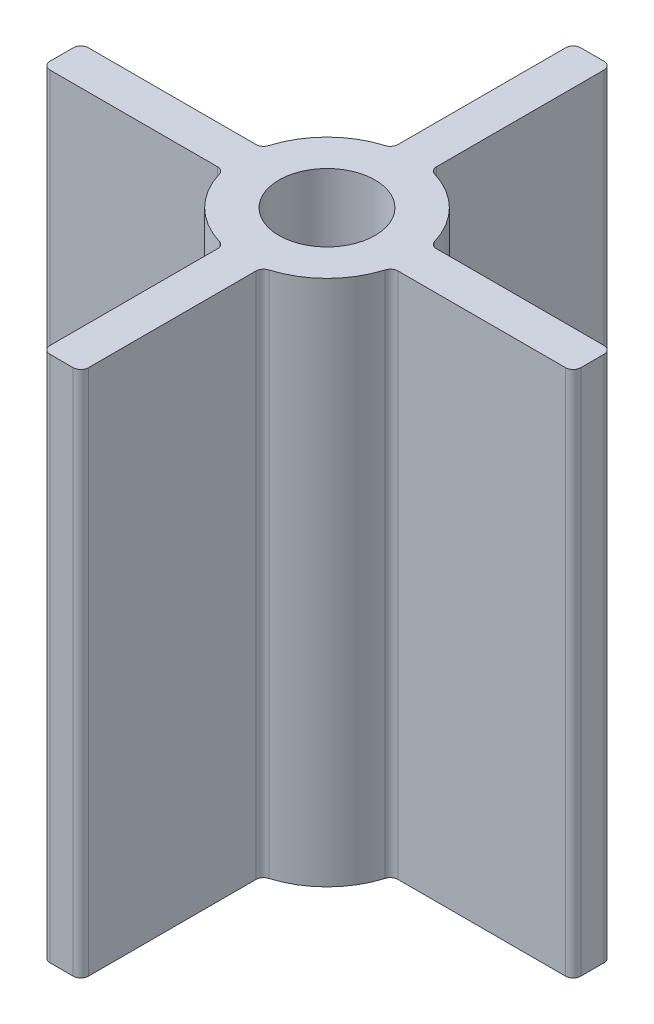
ISO-10303-21;
HEADER;
FILE_DESCRIPTION(('STEP AP214'),'2;1');
FILE_NAME('part.step','',(''),(''),'','','');
FILE_SCHEMA(('AUTOMOTIVE_DESIGN { 1 0 10303 214 1 1 1 1 }'));
ENDSEC;
DATA;
#1=APPLICATION_CONTEXT('core data for automotive mechanical design processes');
#2=APPLICATION_PROTOCOL_DEFINITION('international standard','automotive_design',2000,#1);
#3=PRODUCT_CONTEXT('',#1,'mechanical');
#4=PRODUCT('Part','Part','',(#3));
#5=PRODUCT_RELATED_PRODUCT_CATEGORY('part','',(#4));
#6=PRODUCT_DEFINITION_FORMATION('','',#4);
#7=PRODUCT_DEFINITION_CONTEXT('part definition',#1,'design');
#8=PRODUCT_DEFINITION('design','',#6,#7);
#9=PRODUCT_DEFINITION_SHAPE('','',#8);
#10=(LENGTH_UNIT() NAMED_UNIT(*) SI_UNIT(.MILLI.,.METRE.));
#11=(NAMED_UNIT(*) PLANE_ANGLE_UNIT() SI_UNIT($,.RADIAN.));
#12=(NAMED_UNIT(*) SI_UNIT($,.STERADIAN.) SOLID_ANGLE_UNIT());
#13=UNCERTAINTY_MEASURE_WITH_UNIT(LENGTH_MEASURE(1.E-05),#10,'distance_accuracy_value','');
#14=(GEOMETRIC_REPRESENTATION_CONTEXT(3) GLOBAL_UNCERTAINTY_ASSIGNED_CONTEXT((#13)) GLOBAL_UNIT_ASSIGNED_CONTEXT((#10,
#11,#12)) REPRESENTATION_CONTEXT('',''));
#15=CARTESIAN_POINT('',(0.,0.,0.));
#16=DIRECTION('',(0.,0.,1.));
#17=DIRECTION('',(1.,0.,0.));
#18=AXIS2_PLACEMENT_3D('',#15,#16,#17);
#19=CARTESIAN_POINT('',(0.,34.25,0.));
#20=DIRECTION('',(0.,-1.,0.));
#21=DIRECTION('',(0.,0.,-1.));
#22=AXIS2_PLACEMENT_3D('',#19,#20,#21);
#23=CYLINDRICAL_SURFACE('',#22,11.25);
#24=CARTESIAN_POINT('',(0.,34.25,0.));
#25=DIRECTION('',(0.,1.,0.));
#26=DIRECTION('',(0.,0.,1.));
#27=AXIS2_PLACEMENT_3D('',#24,#25,#26);
#28=CIRCLE('',#27,11.25);
#29=CARTESIAN_POINT('',(-3.21428571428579,34.25,-10.781042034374));
#30=VERTEX_POINT('',#29);
#31=CARTESIAN_POINT('',(-10.781042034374,34.25,-3.2142857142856));
#32=VERTEX_POINT('',#31);
#33=EDGE_CURVE('E259',#30,#32,#28,.T.);
#34=ORIENTED_EDGE('',*,*,#33,.F.);
#35=DIRECTION('',(0.,-1.,0.));
#36=VECTOR('',#35,1.);
#37=CARTESIAN_POINT('',(-3.21428571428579,34.25,-10.781042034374));
#38=LINE('',#37,#36);
#39=CARTESIAN_POINT('',(-3.21428571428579,-34.25,-10.781042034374));
#40=VERTEX_POINT('',#39);
#41=EDGE_CURVE('E308',#30,#40,#38,.T.);
#42=ORIENTED_EDGE('',*,*,#41,.T.);
#43=CARTESIAN_POINT('',(0.,-34.25,0.));
#44=DIRECTION('',(0.,1.,0.));
#45=DIRECTION('',(0.,0.,1.));
#46=AXIS2_PLACEMENT_3D('',#43,#44,#45);
#47=CIRCLE('',#46,11.25);
#48=CARTESIAN_POINT('',(-10.781042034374,-34.25,-3.2142857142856));
#49=VERTEX_POINT('',#48);
#50=EDGE_CURVE('E595',#40,#49,#47,.T.);
#51=ORIENTED_EDGE('',*,*,#50,.T.);
#52=DIRECTION('',(0.,-1.,0.));
#53=VECTOR('',#52,1.);
#54=CARTESIAN_POINT('',(-10.781042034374,34.25,-3.2142857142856));
#55=LINE('',#54,#53);
#56=EDGE_CURVE('E305',#49,#32,#55,.F.);
#57=ORIENTED_EDGE('',*,*,#56,.T.);
#58=EDGE_LOOP('',(#34,#42,#51,#57));
#59=FACE_BOUND('',#58,.T.);
#60=ADVANCED_FACE('F35',(#59),#23,.T.);
#61=CARTESIAN_POINT('',(10.781042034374,-34.25,-3.21428571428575));
#62=VERTEX_POINT('',#61);
#63=CARTESIAN_POINT('',(3.21428571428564,-34.25,-10.781042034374));
#64=VERTEX_POINT('',#63);
#65=EDGE_CURVE('E610',#62,#64,#47,.T.);
#66=ORIENTED_EDGE('',*,*,#65,.T.);
#67=DIRECTION('',(0.,-1.,0.));
#68=VECTOR('',#67,1.);
#69=CARTESIAN_POINT('',(3.21428571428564,34.25,-10.781042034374));
#70=LINE('',#69,#68);
#71=CARTESIAN_POINT('',(3.21428571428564,34.25,-10.781042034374));
#72=VERTEX_POINT('',#71);
#73=EDGE_CURVE('E297',#64,#72,#70,.F.);
#74=ORIENTED_EDGE('',*,*,#73,.T.);
#75=CARTESIAN_POINT('',(10.781042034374,34.25,-3.21428571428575));
#76=VERTEX_POINT('',#75);
#77=EDGE_CURVE('E279',#76,#72,#28,.T.);
#78=ORIENTED_EDGE('',*,*,#77,.F.);
#79=DIRECTION('',(0.,-1.,0.));
#80=VECTOR('',#79,1.);
#81=CARTESIAN_POINT('',(10.781042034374,34.25,-3.21428571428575));
#82=LINE('',#81,#80);
#83=EDGE_CURVE('E294',#76,#62,#82,.T.);
#84=ORIENTED_EDGE('',*,*,#83,.T.);
#85=EDGE_LOOP('',(#66,#74,#78,#84));
#86=FACE_BOUND('',#85,.T.);
#87=ADVANCED_FACE('F514',(#86),#23,.T.);
#88=CARTESIAN_POINT('',(3.21428571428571,-34.25,10.781042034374));
#89=VERTEX_POINT('',#88);
#90=CARTESIAN_POINT('',(10.781042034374,-34.25,3.21428571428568));
#91=VERTEX_POINT('',#90);
#92=EDGE_CURVE('E260',#89,#91,#47,.T.);
#93=ORIENTED_EDGE('',*,*,#92,.T.);
#94=DIRECTION('',(0.,-1.,0.));
#95=VECTOR('',#94,1.);
#96=CARTESIAN_POINT('',(10.781042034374,34.25,3.21428571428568));
#97=LINE('',#96,#95);
#98=CARTESIAN_POINT('',(10.781042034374,34.25,3.21428571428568));
#99=VERTEX_POINT('',#98);
#100=EDGE_CURVE('E286',#91,#99,#97,.F.);
#101=ORIENTED_EDGE('',*,*,#100,.T.);
#102=CARTESIAN_POINT('',(3.21428571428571,34.25,10.781042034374));
#103=VERTEX_POINT('',#102);
#104=EDGE_CURVE('E262',#103,#99,#28,.T.);
#105=ORIENTED_EDGE('',*,*,#104,.F.);
#106=DIRECTION('',(0.,-1.,0.));
#107=VECTOR('',#106,1.);
#108=CARTESIAN_POINT('',(3.21428571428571,34.25,10.781042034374));
#109=LINE('',#108,#107);
#110=EDGE_CURVE('E283',#103,#89,#109,.T.);
#111=ORIENTED_EDGE('',*,*,#110,.T.);
#112=EDGE_LOOP('',(#93,#101,#105,#111));
#113=FACE_BOUND('',#112,.T.);
#114=ADVANCED_FACE('F510',(#113),#23,.T.);
#115=CARTESIAN_POINT('',(0.,34.25,0.));
#116=DIRECTION('',(0.,1.,0.));
#117=DIRECTION('',(0.,0.,1.));
#118=AXIS2_PLACEMENT_3D('',#115,#116,#117);
#119=PLANE('',#118);
#120=DIRECTION('',(0.,0.,1.));
#121=VECTOR('',#120,1.);
#122=CARTESIAN_POINT('',(34.5,34.25,-2.50000000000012));
#123=LINE('',#122,#121);
#124=CARTESIAN_POINT('',(34.5,34.25,-1.50000000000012));
#125=VERTEX_POINT('',#124);
#126=CARTESIAN_POINT('',(34.5,34.25,1.49999999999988));
#127=VERTEX_POINT('',#126);
#128=EDGE_CURVE('E468',#125,#127,#123,.T.);
#129=ORIENTED_EDGE('',*,*,#128,.F.);
#130=CARTESIAN_POINT('',(33.5,34.25,-1.50000000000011));
#131=DIRECTION('',(0.,1.,0.));
#132=DIRECTION('',(0.,0.,1.));
#133=AXIS2_PLACEMENT_3D('',#130,#131,#132);
#134=CIRCLE('',#133,1.);
#135=CARTESIAN_POINT('',(33.5,34.25,-2.50000000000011));
#136=VERTEX_POINT('',#135);
#137=EDGE_CURVE('E397',#125,#136,#134,.T.);
#138=ORIENTED_EDGE('',*,*,#137,.T.);
#139=DIRECTION('',(1.,0.,0.));
#140=VECTOR('',#139,1.);
#141=CARTESIAN_POINT('',(10.25,34.25,-2.50000000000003));
#142=LINE('',#141,#140);
#143=CARTESIAN_POINT('',(11.7393568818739,34.25,-2.50000000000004));
#144=VERTEX_POINT('',#143);
#145=EDGE_CURVE('E464',#144,#136,#142,.T.);
#146=ORIENTED_EDGE('',*,*,#145,.F.);
#147=CARTESIAN_POINT('',(11.7393568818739,34.25,-3.50000000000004));
#148=DIRECTION('',(0.,1.,0.));
#149=DIRECTION('',(0.,0.,1.));
#150=AXIS2_PLACEMENT_3D('',#147,#148,#149);
#151=CIRCLE('',#150,1.);
#152=EDGE_CURVE('E336',#144,#76,#151,.F.);
#153=ORIENTED_EDGE('',*,*,#152,.T.);
#154=ORIENTED_EDGE('',*,*,#77,.T.);
#155=CARTESIAN_POINT('',(3.49999999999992,34.25,-11.7393568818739));
#156=DIRECTION('',(0.,1.,0.));
#157=DIRECTION('',(0.,0.,1.));
#158=AXIS2_PLACEMENT_3D('',#155,#156,#157);
#159=CIRCLE('',#158,1.);
#160=CARTESIAN_POINT('',(2.49999999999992,34.25,-11.7393568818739));
#161=VERTEX_POINT('',#160);
#162=EDGE_CURVE('E329',#72,#161,#159,.F.);
#163=ORIENTED_EDGE('',*,*,#162,.T.);
#164=DIRECTION('',(0.,0.,1.));
#165=VECTOR('',#164,1.);
#166=CARTESIAN_POINT('',(2.49999999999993,34.25,-10.25));
#167=LINE('',#166,#165);
#168=CARTESIAN_POINT('',(2.49999999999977,34.25,-33.5));
#169=VERTEX_POINT('',#168);
#170=EDGE_CURVE('E445',#169,#161,#167,.T.);
#171=ORIENTED_EDGE('',*,*,#170,.F.);
#172=CARTESIAN_POINT('',(1.49999999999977,34.25,-33.5));
#173=DIRECTION('',(0.,1.,0.));
#174=DIRECTION('',(0.,0.,1.));
#175=AXIS2_PLACEMENT_3D('',#172,#173,#174);
#176=CIRCLE('',#175,1.);
#177=CARTESIAN_POINT('',(1.49999999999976,34.25,-34.5));
#178=VERTEX_POINT('',#177);
#179=EDGE_CURVE('E393',#169,#178,#176,.T.);
#180=ORIENTED_EDGE('',*,*,#179,.T.);
#181=DIRECTION('',(1.,0.,0.));
#182=VECTOR('',#181,1.);
#183=CARTESIAN_POINT('',(-2.50000000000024,34.25,-34.5));
#184=LINE('',#183,#182);
#185=CARTESIAN_POINT('',(-1.50000000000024,34.25,-34.5));
#186=VERTEX_POINT('',#185);
#187=EDGE_CURVE('E451',#186,#178,#184,.T.);
#188=ORIENTED_EDGE('',*,*,#187,.F.);
#189=CARTESIAN_POINT('',(-1.50000000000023,34.25,-33.5));
#190=DIRECTION('',(0.,1.,0.));
#191=DIRECTION('',(0.,0.,1.));
#192=AXIS2_PLACEMENT_3D('',#189,#190,#191);
#193=CIRCLE('',#192,1.);
#194=CARTESIAN_POINT('',(-2.50000000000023,34.25,-33.5));
#195=VERTEX_POINT('',#194);
#196=EDGE_CURVE('E391',#186,#195,#193,.T.);
#197=ORIENTED_EDGE('',*,*,#196,.T.);
#198=DIRECTION('',(0.,0.,-1.));
#199=VECTOR('',#198,1.);
#200=CARTESIAN_POINT('',(-2.50000000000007,34.25,-10.25));
#201=LINE('',#200,#199);
#202=CARTESIAN_POINT('',(-2.50000000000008,34.25,-11.7393568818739));
#203=VERTEX_POINT('',#202);
#204=EDGE_CURVE('E447',#203,#195,#201,.T.);
#205=ORIENTED_EDGE('',*,*,#204,.F.);
#206=CARTESIAN_POINT('',(-3.50000000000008,34.25,-11.7393568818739));
#207=DIRECTION('',(0.,1.,0.));
#208=DIRECTION('',(0.,0.,1.));
#209=AXIS2_PLACEMENT_3D('',#206,#207,#208);
#210=CIRCLE('',#209,1.);
#211=EDGE_CURVE('E340',#203,#30,#210,.F.);
#212=ORIENTED_EDGE('',*,*,#211,.T.);
#213=ORIENTED_EDGE('',*,*,#33,.T.);
#214=CARTESIAN_POINT('',(-11.7393568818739,34.25,-3.49999999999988));
#215=DIRECTION('',(0.,1.,0.));
#216=DIRECTION('',(0.,0.,1.));
#217=AXIS2_PLACEMENT_3D('',#214,#215,#216);
#218=CIRCLE('',#217,1.);
#219=CARTESIAN_POINT('',(-11.7393568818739,34.25,-2.49999999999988));
#220=VERTEX_POINT('',#219);
#221=EDGE_CURVE('E342',#32,#220,#218,.F.);
#222=ORIENTED_EDGE('',*,*,#221,.T.);
#223=DIRECTION('',(1.,0.,0.));
#224=VECTOR('',#223,1.);
#225=CARTESIAN_POINT('',(-10.25,34.25,-2.49999999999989));
#226=LINE('',#225,#224);
#227=CARTESIAN_POINT('',(-33.5,34.25,-2.49999999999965));
#228=VERTEX_POINT('',#227);
#229=EDGE_CURVE('E419',#228,#220,#226,.T.);
#230=ORIENTED_EDGE('',*,*,#229,.F.);
#231=CARTESIAN_POINT('',(-33.5,34.25,-1.49999999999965));
#232=DIRECTION('',(0.,1.,0.));
#233=DIRECTION('',(0.,0.,1.));
#234=AXIS2_PLACEMENT_3D('',#231,#232,#233);
#235=CIRCLE('',#234,1.);
#236=CARTESIAN_POINT('',(-34.5,34.25,-1.49999999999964));
#237=VERTEX_POINT('',#236);
#238=EDGE_CURVE('E56',#228,#237,#235,.T.);
#239=ORIENTED_EDGE('',*,*,#238,.T.);
#240=DIRECTION('',(0.,0.,-1.));
#241=VECTOR('',#240,1.);
#242=CARTESIAN_POINT('',(-34.5,34.25,2.50000000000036));
#243=LINE('',#242,#241);
#244=CARTESIAN_POINT('',(-34.5,34.25,1.50000000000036));
#245=VERTEX_POINT('',#244);
#246=EDGE_CURVE('E434',#245,#237,#243,.T.);
#247=ORIENTED_EDGE('',*,*,#246,.F.);
#248=CARTESIAN_POINT('',(-33.5,34.25,1.50000000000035));
#249=DIRECTION('',(0.,1.,0.));
#250=DIRECTION('',(0.,0.,1.));
#251=AXIS2_PLACEMENT_3D('',#248,#249,#250);
#252=CIRCLE('',#251,1.);
#253=CARTESIAN_POINT('',(-33.5,34.25,2.50000000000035));
#254=VERTEX_POINT('',#253);
#255=EDGE_CURVE('E50',#245,#254,#252,.T.);
#256=ORIENTED_EDGE('',*,*,#255,.T.);
#257=DIRECTION('',(-1.,0.,0.));
#258=VECTOR('',#257,1.);
#259=CARTESIAN_POINT('',(-10.25,34.25,2.50000000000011));
#260=LINE('',#259,#258);
#261=CARTESIAN_POINT('',(-11.7393568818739,34.25,2.50000000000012));
#262=VERTEX_POINT('',#261);
#263=EDGE_CURVE('E424',#262,#254,#260,.T.);
#264=ORIENTED_EDGE('',*,*,#263,.F.);
#265=CARTESIAN_POINT('',(-11.7393568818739,34.25,3.50000000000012));
#266=DIRECTION('',(0.,1.,0.));
#267=DIRECTION('',(0.,0.,1.));
#268=AXIS2_PLACEMENT_3D('',#265,#266,#267);
#269=CIRCLE('',#268,1.);
#270=CARTESIAN_POINT('',(-10.781042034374,34.25,3.21428571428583));
#271=VERTEX_POINT('',#270);
#272=EDGE_CURVE('E254',#262,#271,#269,.F.);
#273=ORIENTED_EDGE('',*,*,#272,.T.);
#274=CARTESIAN_POINT('',(-3.21428571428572,34.25,10.781042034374));
#275=VERTEX_POINT('',#274);
#276=EDGE_CURVE('E245',#271,#275,#28,.T.);
#277=ORIENTED_EDGE('',*,*,#276,.T.);
#278=CARTESIAN_POINT('',(-3.5,34.25,11.7393568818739));
#279=DIRECTION('',(0.,1.,0.));
#280=DIRECTION('',(0.,0.,1.));
#281=AXIS2_PLACEMENT_3D('',#278,#279,#280);
#282=CIRCLE('',#281,1.);
#283=CARTESIAN_POINT('',(-2.5,34.25,11.7393568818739));
#284=VERTEX_POINT('',#283);
#285=EDGE_CURVE('E251',#275,#284,#282,.F.);
#286=ORIENTED_EDGE('',*,*,#285,.T.);
#287=DIRECTION('',(0.,0.,-1.));
#288=VECTOR('',#287,1.);
#289=CARTESIAN_POINT('',(-2.5,34.25,10.25));
#290=LINE('',#289,#288);
#291=CARTESIAN_POINT('',(-2.5,34.25,33.5));
#292=VERTEX_POINT('',#291);
#293=EDGE_CURVE('E479',#292,#284,#290,.T.);
#294=ORIENTED_EDGE('',*,*,#293,.F.);
#295=CARTESIAN_POINT('',(-1.5,34.25,33.5));
#296=DIRECTION('',(0.,1.,0.));
#297=DIRECTION('',(0.,0.,1.));
#298=AXIS2_PLACEMENT_3D('',#295,#296,#297);
#299=CIRCLE('',#298,1.);
#300=CARTESIAN_POINT('',(-1.5,34.25,34.5));
#301=VERTEX_POINT('',#300);
#302=EDGE_CURVE('E357',#292,#301,#299,.T.);
#303=ORIENTED_EDGE('',*,*,#302,.T.);
#304=DIRECTION('',(-1.,0.,0.));
#305=VECTOR('',#304,1.);
#306=CARTESIAN_POINT('',(2.5,34.25,34.5));
#307=LINE('',#306,#305);
#308=CARTESIAN_POINT('',(1.5,34.25,34.5));
#309=VERTEX_POINT('',#308);
#310=EDGE_CURVE('E477',#309,#301,#307,.T.);
#311=ORIENTED_EDGE('',*,*,#310,.F.);
#312=CARTESIAN_POINT('',(1.5,34.25,33.5));
#313=DIRECTION('',(0.,1.,0.));
#314=DIRECTION('',(0.,0.,1.));
#315=AXIS2_PLACEMENT_3D('',#312,#313,#314);
#316=CIRCLE('',#315,1.);
#317=CARTESIAN_POINT('',(2.5,34.25,33.5));
#318=VERTEX_POINT('',#317);
#319=EDGE_CURVE('E367',#309,#318,#316,.T.);
#320=ORIENTED_EDGE('',*,*,#319,.T.);
#321=DIRECTION('',(0.,0.,1.));
#322=VECTOR('',#321,1.);
#323=CARTESIAN_POINT('',(2.5,34.25,10.25));
#324=LINE('',#323,#322);
#325=CARTESIAN_POINT('',(2.5,34.25,11.7393568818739));
#326=VERTEX_POINT('',#325);
#327=EDGE_CURVE('E482',#326,#318,#324,.T.);
#328=ORIENTED_EDGE('',*,*,#327,.F.);
#329=CARTESIAN_POINT('',(3.5,34.25,11.7393568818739));
#330=DIRECTION('',(0.,1.,0.));
#331=DIRECTION('',(0.,0.,1.));
#332=AXIS2_PLACEMENT_3D('',#329,#330,#331);
#333=CIRCLE('',#332,1.);
#334=EDGE_CURVE('E327',#326,#103,#333,.F.);
#335=ORIENTED_EDGE('',*,*,#334,.T.);
#336=ORIENTED_EDGE('',*,*,#104,.T.);
#337=CARTESIAN_POINT('',(11.7393568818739,34.25,3.49999999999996));
#338=DIRECTION('',(0.,1.,0.));
#339=DIRECTION('',(0.,0.,1.));
#340=AXIS2_PLACEMENT_3D('',#337,#338,#339);
#341=CIRCLE('',#340,1.);
#342=CARTESIAN_POINT('',(11.7393568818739,34.25,2.49999999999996));
#343=VERTEX_POINT('',#342);
#344=EDGE_CURVE('E320',#99,#343,#341,.F.);
#345=ORIENTED_EDGE('',*,*,#344,.T.);
#346=DIRECTION('',(-1.,0.,0.));
#347=VECTOR('',#346,1.);
#348=CARTESIAN_POINT('',(10.25,34.25,2.49999999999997));
#349=LINE('',#348,#347);
#350=CARTESIAN_POINT('',(33.5,34.25,2.49999999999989));
#351=VERTEX_POINT('',#350);
#352=EDGE_CURVE('E462',#351,#343,#349,.T.);
#353=ORIENTED_EDGE('',*,*,#352,.F.);
#354=CARTESIAN_POINT('',(33.5,34.25,1.49999999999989));
#355=DIRECTION('',(0.,1.,0.));
#356=DIRECTION('',(0.,0.,1.));
#357=AXIS2_PLACEMENT_3D('',#354,#355,#356);
#358=CIRCLE('',#357,1.);
#359=EDGE_CURVE('E395',#351,#127,#358,.T.);
#360=ORIENTED_EDGE('',*,*,#359,.T.);
#361=EDGE_LOOP('',(#129,#138,#146,#153,#154,#163,#171,#180,#188,#197,#205,#212,#213,#222,#230,
#239,#247,#256,#264,#273,#277,#286,#294,#303,#311,#320,#328,#335,#336,#345,#353,#360));
#362=FACE_BOUND('',#361,.T.);
#363=CARTESIAN_POINT('',(0.,34.25,0.));
#364=DIRECTION('',(0.,1.,0.));
#365=DIRECTION('',(0.,0.,1.));
#366=AXIS2_PLACEMENT_3D('',#363,#364,#365);
#367=CIRCLE('',#366,6.25);
#368=CARTESIAN_POINT('',(0.,34.25,6.25));
#369=VERTEX_POINT('',#368);
#370=EDGE_CURVE('E491',#369,#369,#367,.T.);
#371=ORIENTED_EDGE('',*,*,#370,.F.);
#372=EDGE_LOOP('',(#371));
#373=FACE_BOUND('',#372,.T.);
#374=ADVANCED_FACE('F248',(#362,#373),#119,.T.);
#375=CARTESIAN_POINT('',(0.,-34.25,0.));
#376=DIRECTION('',(0.,1.,0.));
#377=DIRECTION('',(0.,0.,1.));
#378=AXIS2_PLACEMENT_3D('',#375,#376,#377);
#379=PLANE('',#378);
#380=DIRECTION('',(1.,0.,0.));
#381=VECTOR('',#380,1.);
#382=CARTESIAN_POINT('',(10.25,-34.25,-2.50000000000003));
#383=LINE('',#382,#381);
#384=CARTESIAN_POINT('',(11.7393568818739,-34.25,-2.50000000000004));
#385=VERTEX_POINT('',#384);
#386=CARTESIAN_POINT('',(33.5,-34.25,-2.50000000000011));
#387=VERTEX_POINT('',#386);
#388=EDGE_CURVE('E473',#385,#387,#383,.T.);
#389=ORIENTED_EDGE('',*,*,#388,.T.);
#390=CARTESIAN_POINT('',(33.5,-34.25,-1.50000000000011));
#391=DIRECTION('',(0.,1.,0.));
#392=DIRECTION('',(0.,0.,1.));
#393=AXIS2_PLACEMENT_3D('',#390,#391,#392);
#394=CIRCLE('',#393,1.);
#395=CARTESIAN_POINT('',(34.5,-34.25,-1.50000000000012));
#396=VERTEX_POINT('',#395);
#397=EDGE_CURVE('E382',#387,#396,#394,.F.);
#398=ORIENTED_EDGE('',*,*,#397,.T.);
#399=DIRECTION('',(0.,0.,1.));
#400=VECTOR('',#399,1.);
#401=CARTESIAN_POINT('',(34.5,-34.25,-2.50000000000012));
#402=LINE('',#401,#400);
#403=CARTESIAN_POINT('',(34.5,-34.25,1.49999999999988));
#404=VERTEX_POINT('',#403);
#405=EDGE_CURVE('E465',#396,#404,#402,.T.);
#406=ORIENTED_EDGE('',*,*,#405,.T.);
#407=CARTESIAN_POINT('',(33.5,-34.25,1.49999999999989));
#408=DIRECTION('',(0.,1.,0.));
#409=DIRECTION('',(0.,0.,1.));
#410=AXIS2_PLACEMENT_3D('',#407,#408,#409);
#411=CIRCLE('',#410,1.);
#412=CARTESIAN_POINT('',(33.5,-34.25,2.49999999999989));
#413=VERTEX_POINT('',#412);
#414=EDGE_CURVE('E380',#404,#413,#411,.F.);
#415=ORIENTED_EDGE('',*,*,#414,.T.);
#416=DIRECTION('',(-1.,0.,0.));
#417=VECTOR('',#416,1.);
#418=CARTESIAN_POINT('',(10.25,-34.25,2.49999999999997));
#419=LINE('',#418,#417);
#420=CARTESIAN_POINT('',(11.7393568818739,-34.25,2.49999999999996));
#421=VERTEX_POINT('',#420);
#422=EDGE_CURVE('E454',#413,#421,#419,.T.);
#423=ORIENTED_EDGE('',*,*,#422,.T.);
#424=CARTESIAN_POINT('',(11.7393568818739,-34.25,3.49999999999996));
#425=DIRECTION('',(0.,1.,0.));
#426=DIRECTION('',(0.,0.,1.));
#427=AXIS2_PLACEMENT_3D('',#424,#425,#426);
#428=CIRCLE('',#427,1.);
#429=EDGE_CURVE('E323',#421,#91,#428,.T.);
#430=ORIENTED_EDGE('',*,*,#429,.T.);
#431=ORIENTED_EDGE('',*,*,#92,.F.);
#432=CARTESIAN_POINT('',(3.5,-34.25,11.7393568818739));
#433=DIRECTION('',(0.,1.,0.));
#434=DIRECTION('',(0.,0.,1.));
#435=AXIS2_PLACEMENT_3D('',#432,#433,#434);
#436=CIRCLE('',#435,1.);
#437=CARTESIAN_POINT('',(2.5,-34.25,11.7393568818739));
#438=VERTEX_POINT('',#437);
#439=EDGE_CURVE('E325',#89,#438,#436,.T.);
#440=ORIENTED_EDGE('',*,*,#439,.T.);
#441=DIRECTION('',(0.,0.,1.));
#442=VECTOR('',#441,1.);
#443=CARTESIAN_POINT('',(2.5,-34.25,10.25));
#444=LINE('',#443,#442);
#445=CARTESIAN_POINT('',(2.5,-34.25,33.5));
#446=VERTEX_POINT('',#445);
#447=EDGE_CURVE('E480',#438,#446,#444,.T.);
#448=ORIENTED_EDGE('',*,*,#447,.T.);
#449=CARTESIAN_POINT('',(1.5,-34.25,33.5));
#450=DIRECTION('',(0.,1.,0.));
#451=DIRECTION('',(0.,0.,1.));
#452=AXIS2_PLACEMENT_3D('',#449,#450,#451);
#453=CIRCLE('',#452,1.);
#454=CARTESIAN_POINT('',(1.5,-34.25,34.5));
#455=VERTEX_POINT('',#454);
#456=EDGE_CURVE('E363',#446,#455,#453,.F.);
#457=ORIENTED_EDGE('',*,*,#456,.T.);
#458=DIRECTION('',(-1.,0.,0.));
#459=VECTOR('',#458,1.);
#460=CARTESIAN_POINT('',(2.5,-34.25,34.5));
#461=LINE('',#460,#459);
#462=CARTESIAN_POINT('',(-1.5,-34.25,34.5));
#463=VERTEX_POINT('',#462);
#464=EDGE_CURVE('E471',#455,#463,#461,.T.);
#465=ORIENTED_EDGE('',*,*,#464,.T.);
#466=CARTESIAN_POINT('',(-1.5,-34.25,33.5));
#467=DIRECTION('',(0.,1.,0.));
#468=DIRECTION('',(0.,0.,1.));
#469=AXIS2_PLACEMENT_3D('',#466,#467,#468);
#470=CIRCLE('',#469,1.);
#471=CARTESIAN_POINT('',(-2.5,-34.25,33.5));
#472=VERTEX_POINT('',#471);
#473=EDGE_CURVE('E353',#463,#472,#470,.F.);
#474=ORIENTED_EDGE('',*,*,#473,.T.);
#475=DIRECTION('',(0.,0.,-1.));
#476=VECTOR('',#475,1.);
#477=CARTESIAN_POINT('',(-2.5,-34.25,10.25));
#478=LINE('',#477,#476);
#479=CARTESIAN_POINT('',(-2.5,-34.25,11.7393568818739));
#480=VERTEX_POINT('',#479);
#481=EDGE_CURVE('E487',#472,#480,#478,.T.);
#482=ORIENTED_EDGE('',*,*,#481,.T.);
#483=CARTESIAN_POINT('',(-3.5,-34.25,11.7393568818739));
#484=DIRECTION('',(0.,1.,0.));
#485=DIRECTION('',(0.,0.,1.));
#486=AXIS2_PLACEMENT_3D('',#483,#484,#485);
#487=CIRCLE('',#486,1.);
#488=CARTESIAN_POINT('',(-3.21428571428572,-34.25,10.781042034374));
#489=VERTEX_POINT('',#488);
#490=EDGE_CURVE('E270',#480,#489,#487,.T.);
#491=ORIENTED_EDGE('',*,*,#490,.T.);
#492=CARTESIAN_POINT('',(-10.781042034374,-34.25,3.21428571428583));
#493=VERTEX_POINT('',#492);
#494=EDGE_CURVE('E274',#493,#489,#47,.T.);
#495=ORIENTED_EDGE('',*,*,#494,.F.);
#496=CARTESIAN_POINT('',(-11.7393568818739,-34.25,3.50000000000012));
#497=DIRECTION('',(0.,1.,0.));
#498=DIRECTION('',(0.,0.,1.));
#499=AXIS2_PLACEMENT_3D('',#496,#497,#498);
#500=CIRCLE('',#499,1.);
#501=CARTESIAN_POINT('',(-11.7393568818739,-34.25,2.50000000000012));
#502=VERTEX_POINT('',#501);
#503=EDGE_CURVE('E347',#493,#502,#500,.T.);
#504=ORIENTED_EDGE('',*,*,#503,.T.);
#505=DIRECTION('',(-1.,0.,0.));
#506=VECTOR('',#505,1.);
#507=CARTESIAN_POINT('',(-10.25,-34.25,2.50000000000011));
#508=LINE('',#507,#506);
#509=CARTESIAN_POINT('',(-33.5,-34.25,2.50000000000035));
#510=VERTEX_POINT('',#509);
#511=EDGE_CURVE('E440',#502,#510,#508,.T.);
#512=ORIENTED_EDGE('',*,*,#511,.T.);
#513=CARTESIAN_POINT('',(-33.5,-34.25,1.50000000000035));
#514=DIRECTION('',(0.,1.,0.));
#515=DIRECTION('',(0.,0.,1.));
#516=AXIS2_PLACEMENT_3D('',#513,#514,#515);
#517=CIRCLE('',#516,1.);
#518=CARTESIAN_POINT('',(-34.5,-34.25,1.50000000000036));
#519=VERTEX_POINT('',#518);
#520=EDGE_CURVE('E372',#510,#519,#517,.F.);
#521=ORIENTED_EDGE('',*,*,#520,.T.);
#522=DIRECTION('',(0.,0.,-1.));
#523=VECTOR('',#522,1.);
#524=CARTESIAN_POINT('',(-34.5,-34.25,2.50000000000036));
#525=LINE('',#524,#523);
#526=CARTESIAN_POINT('',(-34.5,-34.25,-1.49999999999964));
#527=VERTEX_POINT('',#526);
#528=EDGE_CURVE('E425',#519,#527,#525,.T.);
#529=ORIENTED_EDGE('',*,*,#528,.T.);
#530=CARTESIAN_POINT('',(-33.5,-34.25,-1.49999999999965));
#531=DIRECTION('',(0.,1.,0.));
#532=DIRECTION('',(0.,0.,1.));
#533=AXIS2_PLACEMENT_3D('',#530,#531,#532);
#534=CIRCLE('',#533,1.);
#535=CARTESIAN_POINT('',(-33.5,-34.25,-2.49999999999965));
#536=VERTEX_POINT('',#535);
#537=EDGE_CURVE('E374',#527,#536,#534,.F.);
#538=ORIENTED_EDGE('',*,*,#537,.T.);
#539=DIRECTION('',(1.,0.,0.));
#540=VECTOR('',#539,1.);
#541=CARTESIAN_POINT('',(-10.25,-34.25,-2.49999999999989));
#542=LINE('',#541,#540);
#543=CARTESIAN_POINT('',(-11.7393568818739,-34.25,-2.49999999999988));
#544=VERTEX_POINT('',#543);
#545=EDGE_CURVE('E420',#536,#544,#542,.T.);
#546=ORIENTED_EDGE('',*,*,#545,.T.);
#547=CARTESIAN_POINT('',(-11.7393568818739,-34.25,-3.49999999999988));
#548=DIRECTION('',(0.,1.,0.));
#549=DIRECTION('',(0.,0.,1.));
#550=AXIS2_PLACEMENT_3D('',#547,#548,#549);
#551=CIRCLE('',#550,1.);
#552=EDGE_CURVE('E345',#544,#49,#551,.T.);
#553=ORIENTED_EDGE('',*,*,#552,.T.);
#554=ORIENTED_EDGE('',*,*,#50,.F.);
#555=CARTESIAN_POINT('',(-3.50000000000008,-34.25,-11.7393568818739));
#556=DIRECTION('',(0.,1.,0.));
#557=DIRECTION('',(0.,0.,1.));
#558=AXIS2_PLACEMENT_3D('',#555,#556,#557);
#559=CIRCLE('',#558,1.);
#560=CARTESIAN_POINT('',(-2.50000000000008,-34.25,-11.7393568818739));
#561=VERTEX_POINT('',#560);
#562=EDGE_CURVE('E338',#40,#561,#559,.T.);
#563=ORIENTED_EDGE('',*,*,#562,.T.);
#564=DIRECTION('',(0.,0.,-1.));
#565=VECTOR('',#564,1.);
#566=CARTESIAN_POINT('',(-2.50000000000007,-34.25,-10.25));
#567=LINE('',#566,#565);
#568=CARTESIAN_POINT('',(-2.50000000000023,-34.25,-33.5));
#569=VERTEX_POINT('',#568);
#570=EDGE_CURVE('E457',#561,#569,#567,.T.);
#571=ORIENTED_EDGE('',*,*,#570,.T.);
#572=CARTESIAN_POINT('',(-1.50000000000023,-34.25,-33.5));
#573=DIRECTION('',(0.,1.,0.));
#574=DIRECTION('',(0.,0.,1.));
#575=AXIS2_PLACEMENT_3D('',#572,#573,#574);
#576=CIRCLE('',#575,1.);
#577=CARTESIAN_POINT('',(-1.50000000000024,-34.25,-34.5));
#578=VERTEX_POINT('',#577);
#579=EDGE_CURVE('E376',#569,#578,#576,.F.);
#580=ORIENTED_EDGE('',*,*,#579,.T.);
#581=DIRECTION('',(1.,0.,0.));
#582=VECTOR('',#581,1.);
#583=CARTESIAN_POINT('',(-2.50000000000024,-34.25,-34.5));
#584=LINE('',#583,#582);
#585=CARTESIAN_POINT('',(1.49999999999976,-34.25,-34.5));
#586=VERTEX_POINT('',#585);
#587=EDGE_CURVE('E448',#578,#586,#584,.T.);
#588=ORIENTED_EDGE('',*,*,#587,.T.);
#589=CARTESIAN_POINT('',(1.49999999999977,-34.25,-33.5));
#590=DIRECTION('',(0.,1.,0.));
#591=DIRECTION('',(0.,0.,1.));
#592=AXIS2_PLACEMENT_3D('',#589,#590,#591);
#593=CIRCLE('',#592,1.);
#594=CARTESIAN_POINT('',(2.49999999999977,-34.25,-33.5));
#595=VERTEX_POINT('',#594);
#596=EDGE_CURVE('E378',#586,#595,#593,.F.);
#597=ORIENTED_EDGE('',*,*,#596,.T.);
#598=DIRECTION('',(0.,0.,1.));
#599=VECTOR('',#598,1.);
#600=CARTESIAN_POINT('',(2.49999999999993,-34.25,-10.25));
#601=LINE('',#600,#599);
#602=CARTESIAN_POINT('',(2.49999999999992,-34.25,-11.7393568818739));
#603=VERTEX_POINT('',#602);
#604=EDGE_CURVE('E455',#595,#603,#601,.T.);
#605=ORIENTED_EDGE('',*,*,#604,.T.);
#606=CARTESIAN_POINT('',(3.49999999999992,-34.25,-11.7393568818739));
#607=DIRECTION('',(0.,1.,0.));
#608=DIRECTION('',(0.,0.,1.));
#609=AXIS2_PLACEMENT_3D('',#606,#607,#608);
#610=CIRCLE('',#609,1.);
#611=EDGE_CURVE('E332',#603,#64,#610,.T.);
#612=ORIENTED_EDGE('',*,*,#611,.T.);
#613=ORIENTED_EDGE('',*,*,#65,.F.);
#614=CARTESIAN_POINT('',(11.7393568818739,-34.25,-3.50000000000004));
#615=DIRECTION('',(0.,1.,0.));
#616=DIRECTION('',(0.,0.,1.));
#617=AXIS2_PLACEMENT_3D('',#614,#615,#616);
#618=CIRCLE('',#617,1.);
#619=EDGE_CURVE('E334',#62,#385,#618,.T.);
#620=ORIENTED_EDGE('',*,*,#619,.T.);
#621=EDGE_LOOP('',(#389,#398,#406,#415,#423,#430,#431,#440,#448,#457,#465,#474,#482,#491,#495,
#504,#512,#521,#529,#538,#546,#553,#554,#563,#571,#580,#588,#597,#605,#612,#613,#620));
#622=FACE_BOUND('',#621,.T.);
#623=CARTESIAN_POINT('',(0.,-34.25,0.));
#624=DIRECTION('',(0.,1.,0.));
#625=DIRECTION('',(0.,0.,1.));
#626=AXIS2_PLACEMENT_3D('',#623,#624,#625);
#627=CIRCLE('',#626,6.25);
#628=CARTESIAN_POINT('',(0.,-34.25,6.25));
#629=VERTEX_POINT('',#628);
#630=EDGE_CURVE('E485',#629,#629,#627,.T.);
#631=ORIENTED_EDGE('',*,*,#630,.T.);
#632=EDGE_LOOP('',(#631));
#633=FACE_BOUND('',#632,.T.);
#634=ADVANCED_FACE('F437',(#622,#633),#379,.F.);
#635=ORIENTED_EDGE('',*,*,#276,.F.);
#636=DIRECTION('',(0.,-1.,0.));
#637=VECTOR('',#636,1.);
#638=CARTESIAN_POINT('',(-10.781042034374,34.25,3.21428571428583));
#639=LINE('',#638,#637);
#640=EDGE_CURVE('E316',#271,#493,#639,.T.);
#641=ORIENTED_EDGE('',*,*,#640,.T.);
#642=ORIENTED_EDGE('',*,*,#494,.T.);
#643=DIRECTION('',(0.,-1.,0.));
#644=VECTOR('',#643,1.);
#645=CARTESIAN_POINT('',(-3.21428571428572,34.25,10.781042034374));
#646=LINE('',#645,#644);
#647=EDGE_CURVE('E267',#489,#275,#646,.F.);
#648=ORIENTED_EDGE('',*,*,#647,.T.);
#649=EDGE_LOOP('',(#635,#641,#642,#648));
#650=FACE_BOUND('',#649,.T.);
#651=ADVANCED_FACE('F272',(#650),#23,.T.);
#652=CARTESIAN_POINT('',(0.,34.25,0.));
#653=DIRECTION('',(0.,-1.,0.));
#654=DIRECTION('',(0.,0.,-1.));
#655=AXIS2_PLACEMENT_3D('',#652,#653,#654);
#656=CYLINDRICAL_SURFACE('',#655,6.25);
#657=ORIENTED_EDGE('',*,*,#370,.T.);
#658=EDGE_LOOP('',(#657));
#659=FACE_BOUND('',#658,.T.);
#660=ORIENTED_EDGE('',*,*,#630,.F.);
#661=EDGE_LOOP('',(#660));
#662=FACE_BOUND('',#661,.T.);
#663=ADVANCED_FACE('F497',(#659,#662),#656,.F.);
#664=CARTESIAN_POINT('',(2.5,34.25,10.25));
#665=DIRECTION('',(1.,0.,0.));
#666=DIRECTION('',(0.,0.,-1.));
#667=AXIS2_PLACEMENT_3D('',#664,#665,#666);
#668=PLANE('',#667);
#669=ORIENTED_EDGE('',*,*,#327,.T.);
#670=DIRECTION('',(0.,-1.,0.));
#671=VECTOR('',#670,1.);
#672=CARTESIAN_POINT('',(2.5,34.25,33.5));
#673=LINE('',#672,#671);
#674=EDGE_CURVE('E360',#318,#446,#673,.T.);
#675=ORIENTED_EDGE('',*,*,#674,.T.);
#676=ORIENTED_EDGE('',*,*,#447,.F.);
#677=DIRECTION('',(0.,-1.,0.));
#678=VECTOR('',#677,1.);
#679=CARTESIAN_POINT('',(2.5,34.25,11.7393568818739));
#680=LINE('',#679,#678);
#681=EDGE_CURVE('E292',#438,#326,#680,.F.);
#682=ORIENTED_EDGE('',*,*,#681,.T.);
#683=EDGE_LOOP('',(#669,#675,#676,#682));
#684=FACE_BOUND('',#683,.T.);
#685=ADVANCED_FACE('F499',(#684),#668,.T.);
#686=CARTESIAN_POINT('',(-2.5,34.25,10.25));
#687=DIRECTION('',(-1.,0.,0.));
#688=DIRECTION('',(0.,0.,1.));
#689=AXIS2_PLACEMENT_3D('',#686,#687,#688);
#690=PLANE('',#689);
#691=ORIENTED_EDGE('',*,*,#481,.F.);
#692=DIRECTION('',(0.,-1.,0.));
#693=VECTOR('',#692,1.);
#694=CARTESIAN_POINT('',(-2.5,34.25,33.5));
#695=LINE('',#694,#693);
#696=EDGE_CURVE('E355',#472,#292,#695,.F.);
#697=ORIENTED_EDGE('',*,*,#696,.T.);
#698=ORIENTED_EDGE('',*,*,#293,.T.);
#699=DIRECTION('',(0.,-1.,0.));
#700=VECTOR('',#699,1.);
#701=CARTESIAN_POINT('',(-2.5,34.25,11.7393568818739));
#702=LINE('',#701,#700);
#703=EDGE_CURVE('E269',#284,#480,#702,.T.);
#704=ORIENTED_EDGE('',*,*,#703,.T.);
#705=EDGE_LOOP('',(#691,#697,#698,#704));
#706=FACE_BOUND('',#705,.T.);
#707=ADVANCED_FACE('F506',(#706),#690,.T.);
#708=CARTESIAN_POINT('',(2.5,34.25,34.5));
#709=DIRECTION('',(0.,0.,1.));
#710=DIRECTION('',(1.,0.,0.));
#711=AXIS2_PLACEMENT_3D('',#708,#709,#710);
#712=PLANE('',#711);
#713=ORIENTED_EDGE('',*,*,#464,.F.);
#714=DIRECTION('',(0.,-1.,0.));
#715=VECTOR('',#714,1.);
#716=CARTESIAN_POINT('',(1.5,34.25,34.5));
#717=LINE('',#716,#715);
#718=EDGE_CURVE('E365',#455,#309,#717,.F.);
#719=ORIENTED_EDGE('',*,*,#718,.T.);
#720=ORIENTED_EDGE('',*,*,#310,.T.);
#721=DIRECTION('',(0.,-1.,0.));
#722=VECTOR('',#721,1.);
#723=CARTESIAN_POINT('',(-1.5,34.25,34.5));
#724=LINE('',#723,#722);
#725=EDGE_CURVE('E350',#301,#463,#724,.T.);
#726=ORIENTED_EDGE('',*,*,#725,.T.);
#727=EDGE_LOOP('',(#713,#719,#720,#726));
#728=FACE_BOUND('',#727,.T.);
#729=ADVANCED_FACE('F667',(#728),#712,.T.);
#730=CARTESIAN_POINT('',(10.25,34.25,2.49999999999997));
#731=DIRECTION('',(0.,0.,1.));
#732=DIRECTION('',(1.,0.,0.));
#733=AXIS2_PLACEMENT_3D('',#730,#731,#732);
#734=PLANE('',#733);
#735=ORIENTED_EDGE('',*,*,#422,.F.);
#736=DIRECTION('',(0.,-1.,0.));
#737=VECTOR('',#736,1.);
#738=CARTESIAN_POINT('',(33.5,34.25,2.49999999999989));
#739=LINE('',#738,#737);
#740=EDGE_CURVE('E399',#413,#351,#739,.F.);
#741=ORIENTED_EDGE('',*,*,#740,.T.);
#742=ORIENTED_EDGE('',*,*,#352,.T.);
#743=DIRECTION('',(0.,-1.,0.));
#744=VECTOR('',#743,1.);
#745=CARTESIAN_POINT('',(11.7393568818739,34.25,2.49999999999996));
#746=LINE('',#745,#744);
#747=EDGE_CURVE('E289',#343,#421,#746,.T.);
#748=ORIENTED_EDGE('',*,*,#747,.T.);
#749=EDGE_LOOP('',(#735,#741,#742,#748));
#750=FACE_BOUND('',#749,.T.);
#751=ADVANCED_FACE('F624',(#750),#734,.T.);
#752=CARTESIAN_POINT('',(10.25,34.25,-2.50000000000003));
#753=DIRECTION('',(0.,0.,-1.));
#754=DIRECTION('',(-1.,0.,0.));
#755=AXIS2_PLACEMENT_3D('',#752,#753,#754);
#756=PLANE('',#755);
#757=ORIENTED_EDGE('',*,*,#145,.T.);
#758=DIRECTION('',(0.,-1.,0.));
#759=VECTOR('',#758,1.);
#760=CARTESIAN_POINT('',(33.5,34.25,-2.50000000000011));
#761=LINE('',#760,#759);
#762=EDGE_CURVE('E369',#136,#387,#761,.T.);
#763=ORIENTED_EDGE('',*,*,#762,.T.);
#764=ORIENTED_EDGE('',*,*,#388,.F.);
#765=DIRECTION('',(0.,-1.,0.));
#766=VECTOR('',#765,1.);
#767=CARTESIAN_POINT('',(11.7393568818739,34.25,-2.50000000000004));
#768=LINE('',#767,#766);
#769=EDGE_CURVE('E303',#385,#144,#768,.F.);
#770=ORIENTED_EDGE('',*,*,#769,.T.);
#771=EDGE_LOOP('',(#757,#763,#764,#770));
#772=FACE_BOUND('',#771,.T.);
#773=ADVANCED_FACE('F612',(#772),#756,.T.);
#774=CARTESIAN_POINT('',(34.5,34.25,-2.50000000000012));
#775=DIRECTION('',(1.,0.,0.));
#776=DIRECTION('',(0.,0.,-1.));
#777=AXIS2_PLACEMENT_3D('',#774,#775,#776);
#778=PLANE('',#777);
#779=ORIENTED_EDGE('',*,*,#405,.F.);
#780=DIRECTION('',(0.,-1.,0.));
#781=VECTOR('',#780,1.);
#782=CARTESIAN_POINT('',(34.5,34.25,-1.50000000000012));
#783=LINE('',#782,#781);
#784=EDGE_CURVE('E387',#396,#125,#783,.F.);
#785=ORIENTED_EDGE('',*,*,#784,.T.);
#786=ORIENTED_EDGE('',*,*,#128,.T.);
#787=DIRECTION('',(0.,-1.,0.));
#788=VECTOR('',#787,1.);
#789=CARTESIAN_POINT('',(34.5,34.25,1.49999999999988));
#790=LINE('',#789,#788);
#791=EDGE_CURVE('E384',#127,#404,#790,.T.);
#792=ORIENTED_EDGE('',*,*,#791,.T.);
#793=EDGE_LOOP('',(#779,#785,#786,#792));
#794=FACE_BOUND('',#793,.T.);
#795=ADVANCED_FACE('F618',(#794),#778,.T.);
#796=CARTESIAN_POINT('',(2.49999999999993,34.25,-10.25));
#797=DIRECTION('',(1.,0.,0.));
#798=DIRECTION('',(0.,0.,-1.));
#799=AXIS2_PLACEMENT_3D('',#796,#797,#798);
#800=PLANE('',#799);
#801=ORIENTED_EDGE('',*,*,#604,.F.);
#802=DIRECTION('',(0.,-1.,0.));
#803=VECTOR('',#802,1.);
#804=CARTESIAN_POINT('',(2.49999999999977,34.25,-33.5));
#805=LINE('',#804,#803);
#806=EDGE_CURVE('E406',#595,#169,#805,.F.);
#807=ORIENTED_EDGE('',*,*,#806,.T.);
#808=ORIENTED_EDGE('',*,*,#170,.T.);
#809=DIRECTION('',(0.,-1.,0.));
#810=VECTOR('',#809,1.);
#811=CARTESIAN_POINT('',(2.49999999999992,34.25,-11.7393568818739));
#812=LINE('',#811,#810);
#813=EDGE_CURVE('E300',#161,#603,#812,.T.);
#814=ORIENTED_EDGE('',*,*,#813,.T.);
#815=EDGE_LOOP('',(#801,#807,#808,#814));
#816=FACE_BOUND('',#815,.T.);
#817=ADVANCED_FACE('F637',(#816),#800,.T.);
#818=CARTESIAN_POINT('',(-2.50000000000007,34.25,-10.25));
#819=DIRECTION('',(-1.,0.,0.));
#820=DIRECTION('',(0.,0.,1.));
#821=AXIS2_PLACEMENT_3D('',#818,#819,#820);
#822=PLANE('',#821);
#823=ORIENTED_EDGE('',*,*,#204,.T.);
#824=DIRECTION('',(0.,-1.,0.));
#825=VECTOR('',#824,1.);
#826=CARTESIAN_POINT('',(-2.50000000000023,34.25,-33.5));
#827=LINE('',#826,#825);
#828=EDGE_CURVE('E408',#195,#569,#827,.T.);
#829=ORIENTED_EDGE('',*,*,#828,.T.);
#830=ORIENTED_EDGE('',*,*,#570,.F.);
#831=DIRECTION('',(0.,-1.,0.));
#832=VECTOR('',#831,1.);
#833=CARTESIAN_POINT('',(-2.50000000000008,34.25,-11.7393568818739));
#834=LINE('',#833,#832);
#835=EDGE_CURVE('E311',#561,#203,#834,.F.);
#836=ORIENTED_EDGE('',*,*,#835,.T.);
#837=EDGE_LOOP('',(#823,#829,#830,#836));
#838=FACE_BOUND('',#837,.T.);
#839=ADVANCED_FACE('F650',(#838),#822,.T.);
#840=CARTESIAN_POINT('',(-2.50000000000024,34.25,-34.5));
#841=DIRECTION('',(0.,0.,-1.));
#842=DIRECTION('',(-1.,0.,0.));
#843=AXIS2_PLACEMENT_3D('',#840,#841,#842);
#844=PLANE('',#843);
#845=ORIENTED_EDGE('',*,*,#187,.T.);
#846=DIRECTION('',(0.,-1.,0.));
#847=VECTOR('',#846,1.);
#848=CARTESIAN_POINT('',(1.49999999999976,34.25,-34.5));
#849=LINE('',#848,#847);
#850=EDGE_CURVE('E403',#178,#586,#849,.T.);
#851=ORIENTED_EDGE('',*,*,#850,.T.);
#852=ORIENTED_EDGE('',*,*,#587,.F.);
#853=DIRECTION('',(0.,-1.,0.));
#854=VECTOR('',#853,1.);
#855=CARTESIAN_POINT('',(-1.50000000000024,34.25,-34.5));
#856=LINE('',#855,#854);
#857=EDGE_CURVE('E401',#578,#186,#856,.F.);
#858=ORIENTED_EDGE('',*,*,#857,.T.);
#859=EDGE_LOOP('',(#845,#851,#852,#858));
#860=FACE_BOUND('',#859,.T.);
#861=ADVANCED_FACE('F644',(#860),#844,.T.);
#862=CARTESIAN_POINT('',(-10.25,34.25,-2.49999999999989));
#863=DIRECTION('',(0.,0.,-1.));
#864=DIRECTION('',(-1.,0.,0.));
#865=AXIS2_PLACEMENT_3D('',#862,#863,#864);
#866=PLANE('',#865);
#867=ORIENTED_EDGE('',*,*,#545,.F.);
#868=DIRECTION('',(0.,-1.,0.));
#869=VECTOR('',#868,1.);
#870=CARTESIAN_POINT('',(-33.5,34.25,-2.49999999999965));
#871=LINE('',#870,#869);
#872=EDGE_CURVE('E43',#536,#228,#871,.F.);
#873=ORIENTED_EDGE('',*,*,#872,.T.);
#874=ORIENTED_EDGE('',*,*,#229,.T.);
#875=DIRECTION('',(0.,-1.,0.));
#876=VECTOR('',#875,1.);
#877=CARTESIAN_POINT('',(-11.7393568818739,34.25,-2.49999999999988));
#878=LINE('',#877,#876);
#879=EDGE_CURVE('E313',#220,#544,#878,.T.);
#880=ORIENTED_EDGE('',*,*,#879,.T.);
#881=EDGE_LOOP('',(#867,#873,#874,#880));
#882=FACE_BOUND('',#881,.T.);
#883=ADVANCED_FACE('F418',(#882),#866,.T.);
#884=CARTESIAN_POINT('',(-10.25,34.25,2.50000000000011));
#885=DIRECTION('',(0.,0.,1.));
#886=DIRECTION('',(1.,0.,0.));
#887=AXIS2_PLACEMENT_3D('',#884,#885,#886);
#888=PLANE('',#887);
#889=ORIENTED_EDGE('',*,*,#263,.T.);
#890=DIRECTION('',(0.,-1.,0.));
#891=VECTOR('',#890,1.);
#892=CARTESIAN_POINT('',(-33.5,34.25,2.50000000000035));
#893=LINE('',#892,#891);
#894=EDGE_CURVE('E11',#254,#510,#893,.T.);
#895=ORIENTED_EDGE('',*,*,#894,.T.);
#896=ORIENTED_EDGE('',*,*,#511,.F.);
#897=DIRECTION('',(0.,-1.,0.));
#898=VECTOR('',#897,1.);
#899=CARTESIAN_POINT('',(-11.7393568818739,34.25,2.50000000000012));
#900=LINE('',#899,#898);
#901=EDGE_CURVE('E318',#502,#262,#900,.F.);
#902=ORIENTED_EDGE('',*,*,#901,.T.);
#903=EDGE_LOOP('',(#889,#895,#896,#902));
#904=FACE_BOUND('',#903,.T.);
#905=ADVANCED_FACE('F586',(#904),#888,.T.);
#906=CARTESIAN_POINT('',(-34.5,34.25,2.50000000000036));
#907=DIRECTION('',(-1.,0.,0.));
#908=DIRECTION('',(0.,0.,1.));
#909=AXIS2_PLACEMENT_3D('',#906,#907,#908);
#910=PLANE('',#909);
#911=ORIENTED_EDGE('',*,*,#246,.T.);
#912=DIRECTION('',(0.,-1.,0.));
#913=VECTOR('',#912,1.);
#914=CARTESIAN_POINT('',(-34.5,34.25,-1.49999999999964));
#915=LINE('',#914,#913);
#916=EDGE_CURVE('E413',#237,#527,#915,.T.);
#917=ORIENTED_EDGE('',*,*,#916,.T.);
#918=ORIENTED_EDGE('',*,*,#528,.F.);
#919=DIRECTION('',(0.,-1.,0.));
#920=VECTOR('',#919,1.);
#921=CARTESIAN_POINT('',(-34.5,34.25,1.50000000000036));
#922=LINE('',#921,#920);
#923=EDGE_CURVE('E411',#519,#245,#922,.F.);
#924=ORIENTED_EDGE('',*,*,#923,.T.);
#925=EDGE_LOOP('',(#911,#917,#918,#924));
#926=FACE_BOUND('',#925,.T.);
#927=ADVANCED_FACE('F432',(#926),#910,.T.);
#928=CARTESIAN_POINT('',(-3.5,34.25,11.7393568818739));
#929=DIRECTION('',(0.,-1.,0.));
#930=DIRECTION('',(0.,0.,-1.));
#931=AXIS2_PLACEMENT_3D('',#928,#929,#930);
#932=CYLINDRICAL_SURFACE('',#931,1.);
#933=ORIENTED_EDGE('',*,*,#490,.F.);
#934=ORIENTED_EDGE('',*,*,#703,.F.);
#935=ORIENTED_EDGE('',*,*,#285,.F.);
#936=ORIENTED_EDGE('',*,*,#647,.F.);
#937=EDGE_LOOP('',(#933,#934,#935,#936));
#938=FACE_BOUND('',#937,.T.);
#939=ADVANCED_FACE('F266',(#938),#932,.F.);
#940=CARTESIAN_POINT('',(11.7393568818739,34.25,3.49999999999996));
#941=DIRECTION('',(0.,-1.,0.));
#942=DIRECTION('',(0.,0.,-1.));
#943=AXIS2_PLACEMENT_3D('',#940,#941,#942);
#944=CYLINDRICAL_SURFACE('',#943,1.);
#945=ORIENTED_EDGE('',*,*,#429,.F.);
#946=ORIENTED_EDGE('',*,*,#747,.F.);
#947=ORIENTED_EDGE('',*,*,#344,.F.);
#948=ORIENTED_EDGE('',*,*,#100,.F.);
#949=EDGE_LOOP('',(#945,#946,#947,#948));
#950=FACE_BOUND('',#949,.T.);
#951=ADVANCED_FACE('F525',(#950),#944,.F.);
#952=CARTESIAN_POINT('',(3.5,34.25,11.7393568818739));
#953=DIRECTION('',(0.,-1.,0.));
#954=DIRECTION('',(0.,0.,-1.));
#955=AXIS2_PLACEMENT_3D('',#952,#953,#954);
#956=CYLINDRICAL_SURFACE('',#955,1.);
#957=ORIENTED_EDGE('',*,*,#334,.F.);
#958=ORIENTED_EDGE('',*,*,#681,.F.);
#959=ORIENTED_EDGE('',*,*,#439,.F.);
#960=ORIENTED_EDGE('',*,*,#110,.F.);
#961=EDGE_LOOP('',(#957,#958,#959,#960));
#962=FACE_BOUND('',#961,.T.);
#963=ADVANCED_FACE('F528',(#962),#956,.F.);
#964=CARTESIAN_POINT('',(3.49999999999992,34.25,-11.7393568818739));
#965=DIRECTION('',(0.,-1.,0.));
#966=DIRECTION('',(0.,0.,-1.));
#967=AXIS2_PLACEMENT_3D('',#964,#965,#966);
#968=CYLINDRICAL_SURFACE('',#967,1.);
#969=ORIENTED_EDGE('',*,*,#611,.F.);
#970=ORIENTED_EDGE('',*,*,#813,.F.);
#971=ORIENTED_EDGE('',*,*,#162,.F.);
#972=ORIENTED_EDGE('',*,*,#73,.F.);
#973=EDGE_LOOP('',(#969,#970,#971,#972));
#974=FACE_BOUND('',#973,.T.);
#975=ADVANCED_FACE('F532',(#974),#968,.F.);
#976=CARTESIAN_POINT('',(11.7393568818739,34.25,-3.50000000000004));
#977=DIRECTION('',(0.,-1.,0.));
#978=DIRECTION('',(0.,0.,-1.));
#979=AXIS2_PLACEMENT_3D('',#976,#977,#978);
#980=CYLINDRICAL_SURFACE('',#979,1.);
#981=ORIENTED_EDGE('',*,*,#152,.F.);
#982=ORIENTED_EDGE('',*,*,#769,.F.);
#983=ORIENTED_EDGE('',*,*,#619,.F.);
#984=ORIENTED_EDGE('',*,*,#83,.F.);
#985=EDGE_LOOP('',(#981,#982,#983,#984));
#986=FACE_BOUND('',#985,.T.);
#987=ADVANCED_FACE('F536',(#986),#980,.F.);
#988=CARTESIAN_POINT('',(-3.50000000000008,34.25,-11.7393568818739));
#989=DIRECTION('',(0.,-1.,0.));
#990=DIRECTION('',(0.,0.,-1.));
#991=AXIS2_PLACEMENT_3D('',#988,#989,#990);
#992=CYLINDRICAL_SURFACE('',#991,1.);
#993=ORIENTED_EDGE('',*,*,#211,.F.);
#994=ORIENTED_EDGE('',*,*,#835,.F.);
#995=ORIENTED_EDGE('',*,*,#562,.F.);
#996=ORIENTED_EDGE('',*,*,#41,.F.);
#997=EDGE_LOOP('',(#993,#994,#995,#996));
#998=FACE_BOUND('',#997,.T.);
#999=ADVANCED_FACE('F540',(#998),#992,.F.);
#1000=CARTESIAN_POINT('',(-11.7393568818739,34.25,-3.49999999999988));
#1001=DIRECTION('',(0.,-1.,0.));
#1002=DIRECTION('',(0.,0.,-1.));
#1003=AXIS2_PLACEMENT_3D('',#1000,#1001,#1002);
#1004=CYLINDRICAL_SURFACE('',#1003,1.);
#1005=ORIENTED_EDGE('',*,*,#552,.F.);
#1006=ORIENTED_EDGE('',*,*,#879,.F.);
#1007=ORIENTED_EDGE('',*,*,#221,.F.);
#1008=ORIENTED_EDGE('',*,*,#56,.F.);
#1009=EDGE_LOOP('',(#1005,#1006,#1007,#1008));
#1010=FACE_BOUND('',#1009,.T.);
#1011=ADVANCED_FACE('F544',(#1010),#1004,.F.);
#1012=CARTESIAN_POINT('',(-11.7393568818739,34.25,3.50000000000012));
#1013=DIRECTION('',(0.,-1.,0.));
#1014=DIRECTION('',(0.,0.,-1.));
#1015=AXIS2_PLACEMENT_3D('',#1012,#1013,#1014);
#1016=CYLINDRICAL_SURFACE('',#1015,1.);
#1017=ORIENTED_EDGE('',*,*,#272,.F.);
#1018=ORIENTED_EDGE('',*,*,#901,.F.);
#1019=ORIENTED_EDGE('',*,*,#503,.F.);
#1020=ORIENTED_EDGE('',*,*,#640,.F.);
#1021=EDGE_LOOP('',(#1017,#1018,#1019,#1020));
#1022=FACE_BOUND('',#1021,.T.);
#1023=ADVANCED_FACE('F548',(#1022),#1016,.F.);
#1024=CARTESIAN_POINT('',(-1.5,34.25,33.5));
#1025=DIRECTION('',(0.,-1.,0.));
#1026=DIRECTION('',(0.,0.,-1.));
#1027=AXIS2_PLACEMENT_3D('',#1024,#1025,#1026);
#1028=CYLINDRICAL_SURFACE('',#1027,1.);
#1029=ORIENTED_EDGE('',*,*,#302,.F.);
#1030=ORIENTED_EDGE('',*,*,#696,.F.);
#1031=ORIENTED_EDGE('',*,*,#473,.F.);
#1032=ORIENTED_EDGE('',*,*,#725,.F.);
#1033=EDGE_LOOP('',(#1029,#1030,#1031,#1032));
#1034=FACE_BOUND('',#1033,.T.);
#1035=ADVANCED_FACE('F552',(#1034),#1028,.T.);
#1036=CARTESIAN_POINT('',(1.5,34.25,33.5));
#1037=DIRECTION('',(0.,-1.,0.));
#1038=DIRECTION('',(0.,0.,-1.));
#1039=AXIS2_PLACEMENT_3D('',#1036,#1037,#1038);
#1040=CYLINDRICAL_SURFACE('',#1039,1.);
#1041=ORIENTED_EDGE('',*,*,#319,.F.);
#1042=ORIENTED_EDGE('',*,*,#718,.F.);
#1043=ORIENTED_EDGE('',*,*,#456,.F.);
#1044=ORIENTED_EDGE('',*,*,#674,.F.);
#1045=EDGE_LOOP('',(#1041,#1042,#1043,#1044));
#1046=FACE_BOUND('',#1045,.T.);
#1047=ADVANCED_FACE('F556',(#1046),#1040,.T.);
#1048=CARTESIAN_POINT('',(33.5,34.25,-1.50000000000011));
#1049=DIRECTION('',(0.,-1.,0.));
#1050=DIRECTION('',(0.,0.,-1.));
#1051=AXIS2_PLACEMENT_3D('',#1048,#1049,#1050);
#1052=CYLINDRICAL_SURFACE('',#1051,1.);
#1053=ORIENTED_EDGE('',*,*,#137,.F.);
#1054=ORIENTED_EDGE('',*,*,#784,.F.);
#1055=ORIENTED_EDGE('',*,*,#397,.F.);
#1056=ORIENTED_EDGE('',*,*,#762,.F.);
#1057=EDGE_LOOP('',(#1053,#1054,#1055,#1056));
#1058=FACE_BOUND('',#1057,.T.);
#1059=ADVANCED_FACE('F560',(#1058),#1052,.T.);
#1060=CARTESIAN_POINT('',(33.5,34.25,1.49999999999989));
#1061=DIRECTION('',(0.,-1.,0.));
#1062=DIRECTION('',(0.,0.,-1.));
#1063=AXIS2_PLACEMENT_3D('',#1060,#1061,#1062);
#1064=CYLINDRICAL_SURFACE('',#1063,1.);
#1065=ORIENTED_EDGE('',*,*,#359,.F.);
#1066=ORIENTED_EDGE('',*,*,#740,.F.);
#1067=ORIENTED_EDGE('',*,*,#414,.F.);
#1068=ORIENTED_EDGE('',*,*,#791,.F.);
#1069=EDGE_LOOP('',(#1065,#1066,#1067,#1068));
#1070=FACE_BOUND('',#1069,.T.);
#1071=ADVANCED_FACE('F564',(#1070),#1064,.T.);
#1072=CARTESIAN_POINT('',(1.49999999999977,34.25,-33.5));
#1073=DIRECTION('',(0.,-1.,0.));
#1074=DIRECTION('',(0.,0.,-1.));
#1075=AXIS2_PLACEMENT_3D('',#1072,#1073,#1074);
#1076=CYLINDRICAL_SURFACE('',#1075,1.);
#1077=ORIENTED_EDGE('',*,*,#179,.F.);
#1078=ORIENTED_EDGE('',*,*,#806,.F.);
#1079=ORIENTED_EDGE('',*,*,#596,.F.);
#1080=ORIENTED_EDGE('',*,*,#850,.F.);
#1081=EDGE_LOOP('',(#1077,#1078,#1079,#1080));
#1082=FACE_BOUND('',#1081,.T.);
#1083=ADVANCED_FACE('F568',(#1082),#1076,.T.);
#1084=CARTESIAN_POINT('',(-1.50000000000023,34.25,-33.5));
#1085=DIRECTION('',(0.,-1.,0.));
#1086=DIRECTION('',(0.,0.,-1.));
#1087=AXIS2_PLACEMENT_3D('',#1084,#1085,#1086);
#1088=CYLINDRICAL_SURFACE('',#1087,1.);
#1089=ORIENTED_EDGE('',*,*,#196,.F.);
#1090=ORIENTED_EDGE('',*,*,#857,.F.);
#1091=ORIENTED_EDGE('',*,*,#579,.F.);
#1092=ORIENTED_EDGE('',*,*,#828,.F.);
#1093=EDGE_LOOP('',(#1089,#1090,#1091,#1092));
#1094=FACE_BOUND('',#1093,.T.);
#1095=ADVANCED_FACE('F572',(#1094),#1088,.T.);
#1096=CARTESIAN_POINT('',(-33.5,34.25,-1.49999999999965));
#1097=DIRECTION('',(0.,-1.,0.));
#1098=DIRECTION('',(0.,0.,-1.));
#1099=AXIS2_PLACEMENT_3D('',#1096,#1097,#1098);
#1100=CYLINDRICAL_SURFACE('',#1099,1.);
#1101=ORIENTED_EDGE('',*,*,#238,.F.);
#1102=ORIENTED_EDGE('',*,*,#872,.F.);
#1103=ORIENTED_EDGE('',*,*,#537,.F.);
#1104=ORIENTED_EDGE('',*,*,#916,.F.);
#1105=EDGE_LOOP('',(#1101,#1102,#1103,#1104));
#1106=FACE_BOUND('',#1105,.T.);
#1107=ADVANCED_FACE('F428',(#1106),#1100,.T.);
#1108=CARTESIAN_POINT('',(-33.5,34.25,1.50000000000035));
#1109=DIRECTION('',(0.,-1.,0.));
#1110=DIRECTION('',(0.,0.,-1.));
#1111=AXIS2_PLACEMENT_3D('',#1108,#1109,#1110);
#1112=CYLINDRICAL_SURFACE('',#1111,1.);
#1113=ORIENTED_EDGE('',*,*,#255,.F.);
#1114=ORIENTED_EDGE('',*,*,#923,.F.);
#1115=ORIENTED_EDGE('',*,*,#520,.F.);
#1116=ORIENTED_EDGE('',*,*,#894,.F.);
#1117=EDGE_LOOP('',(#1113,#1114,#1115,#1116));
#1118=FACE_BOUND('',#1117,.T.);
#1119=ADVANCED_FACE('F37',(#1118),#1112,.T.);
#1120=CLOSED_SHELL('',(#60,#87,#114,#374,#634,#651,#663,#685,#707,#729,#751,#773,#795,#817,#839,
#861,#883,#905,#927,#939,#951,#963,#975,#987,#999,#1011,#1023,#1035,#1047,#1059,#1071,#1083,
#1095,#1107,#1119));
#1121=MANIFOLD_SOLID_BREP('B2',#1120);
#1122=ADVANCED_BREP_SHAPE_REPRESENTATION('',(#18,#1121),#14);
#1123=SHAPE_DEFINITION_REPRESENTATION(#9,#1122);
ENDSEC;
END-ISO-10303-21;
